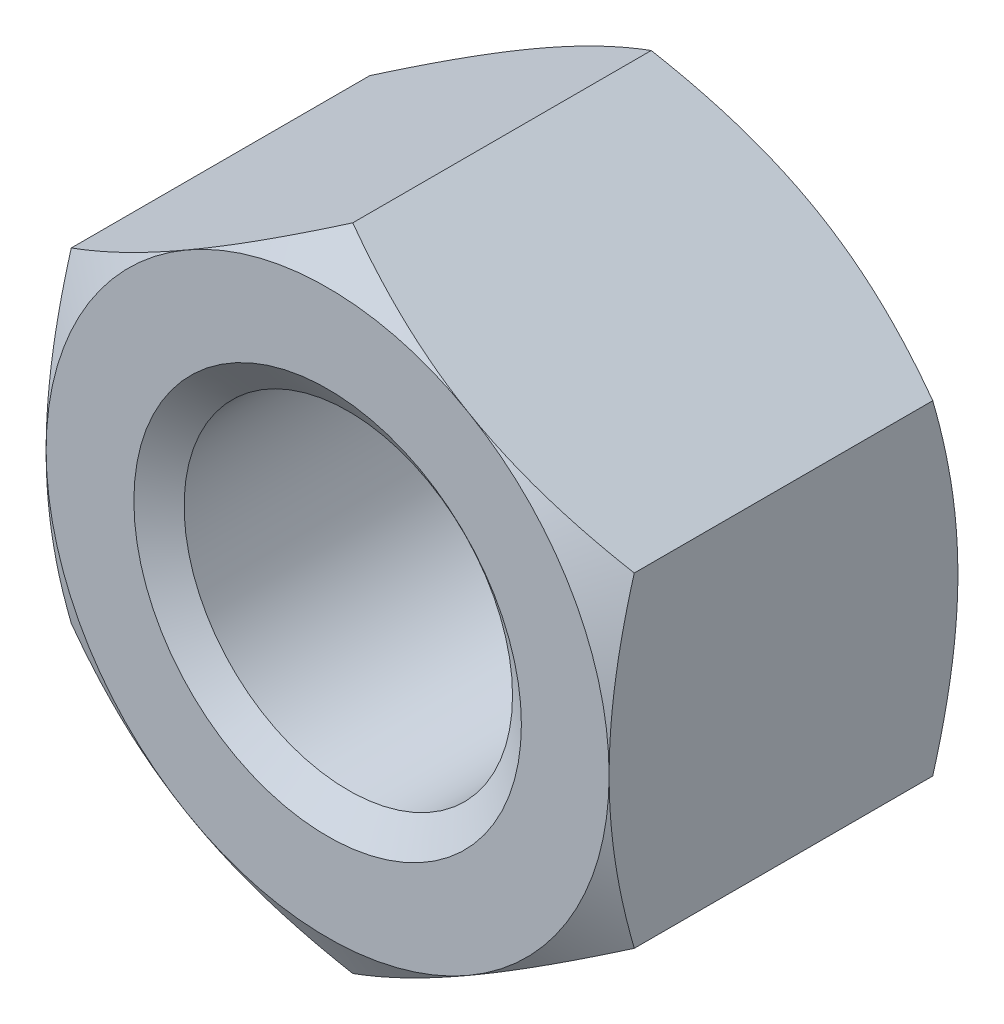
ISO-10303-21;
HEADER;
FILE_DESCRIPTION(('STEP AP214'),'2;1');
FILE_NAME('part.step','',(''),(''),'','','');
FILE_SCHEMA(('AUTOMOTIVE_DESIGN { 1 0 10303 214 1 1 1 1 }'));
ENDSEC;
DATA;
#1=APPLICATION_CONTEXT('core data for automotive mechanical design processes');
#2=APPLICATION_PROTOCOL_DEFINITION('international standard','automotive_design',2000,#1);
#3=PRODUCT_CONTEXT('',#1,'mechanical');
#4=PRODUCT('Part','Part','',(#3));
#5=PRODUCT_RELATED_PRODUCT_CATEGORY('part','',(#4));
#6=PRODUCT_DEFINITION_FORMATION('','',#4);
#7=PRODUCT_DEFINITION_CONTEXT('part definition',#1,'design');
#8=PRODUCT_DEFINITION('design','',#6,#7);
#9=PRODUCT_DEFINITION_SHAPE('','',#8);
#10=(LENGTH_UNIT() NAMED_UNIT(*) SI_UNIT(.MILLI.,.METRE.));
#11=(NAMED_UNIT(*) PLANE_ANGLE_UNIT() SI_UNIT($,.RADIAN.));
#12=(NAMED_UNIT(*) SI_UNIT($,.STERADIAN.) SOLID_ANGLE_UNIT());
#13=UNCERTAINTY_MEASURE_WITH_UNIT(LENGTH_MEASURE(1.E-05),#10,'distance_accuracy_value','');
#14=(GEOMETRIC_REPRESENTATION_CONTEXT(3) GLOBAL_UNCERTAINTY_ASSIGNED_CONTEXT((#13)) GLOBAL_UNIT_ASSIGNED_CONTEXT((#10,
#11,#12)) REPRESENTATION_CONTEXT('',''));
#15=CARTESIAN_POINT('',(0.,0.,0.));
#16=DIRECTION('',(0.,0.,1.));
#17=DIRECTION('',(1.,0.,0.));
#18=AXIS2_PLACEMENT_3D('',#15,#16,#17);
#19=CARTESIAN_POINT('',(0.,0.,-22.3));
#20=DIRECTION('',(0.,0.,1.));
#21=DIRECTION('',(1.,0.,0.));
#22=AXIS2_PLACEMENT_3D('',#19,#20,#21);
#23=CYLINDRICAL_SURFACE('',#22,10.5);
#24=CARTESIAN_POINT('',(0.,0.,-1.32339224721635));
#25=DIRECTION('',(0.,0.,1.));
#26=DIRECTION('',(1.,0.,0.));
#27=AXIS2_PLACEMENT_3D('',#24,#25,#26);
#28=CIRCLE('',#27,10.5);
#29=CARTESIAN_POINT('',(10.5,0.,-1.32339224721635));
#30=VERTEX_POINT('',#29);
#31=EDGE_CURVE('E324',#30,#30,#28,.T.);
#32=ORIENTED_EDGE('',*,*,#31,.T.);
#33=EDGE_LOOP('',(#32));
#34=FACE_BOUND('',#33,.T.);
#35=CARTESIAN_POINT('',(0.,0.,-20.9766077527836));
#36=DIRECTION('',(0.,0.,1.));
#37=DIRECTION('',(1.,0.,0.));
#38=AXIS2_PLACEMENT_3D('',#35,#36,#37);
#39=CIRCLE('',#38,10.5);
#40=CARTESIAN_POINT('',(10.5,0.,-20.9766077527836));
#41=VERTEX_POINT('',#40);
#42=EDGE_CURVE('E327',#41,#41,#39,.T.);
#43=ORIENTED_EDGE('',*,*,#42,.F.);
#44=EDGE_LOOP('',(#43));
#45=FACE_BOUND('',#44,.T.);
#46=ADVANCED_FACE('F39',(#34,#45),#23,.F.);
#47=CARTESIAN_POINT('',(0.,20.7846096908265,-22.3));
#48=DIRECTION('',(-0.5,0.866025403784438,0.));
#49=DIRECTION('',(-0.866025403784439,-0.5,0.));
#50=AXIS2_PLACEMENT_3D('',#47,#48,#49);
#51=PLANE('',#50);
#52=DIRECTION('',(0.,0.,1.));
#53=VECTOR('',#52,1.);
#54=CARTESIAN_POINT('',(-18.,10.3923048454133,-22.3));
#55=LINE('',#54,#53);
#56=CARTESIAN_POINT('',(-18.,10.3923048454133,-20.6923048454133));
#57=VERTEX_POINT('',#56);
#58=CARTESIAN_POINT('',(-18.,10.3923048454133,-1.60769515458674));
#59=VERTEX_POINT('',#58);
#60=EDGE_CURVE('E168',#57,#59,#55,.T.);
#61=ORIENTED_EDGE('',*,*,#60,.T.);
#62=CARTESIAN_POINT('',(-18.0002,10.3921893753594,-1.60776182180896));
#63=CARTESIAN_POINT('',(-17.6045674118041,10.6206079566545,-1.47589336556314));
#64=CARTESIAN_POINT('',(-17.2073916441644,10.8499174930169,-1.3500088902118));
#65=CARTESIAN_POINT('',(-16.4098552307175,11.310375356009,-1.11187123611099));
#66=CARTESIAN_POINT('',(-16.0094935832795,11.5415242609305,-0.999622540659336));
#67=CARTESIAN_POINT('',(-15.2048116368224,12.0061075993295,-0.790265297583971));
#68=CARTESIAN_POINT('',(-14.8004842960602,12.2395460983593,-0.693192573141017));
#69=CARTESIAN_POINT('',(-13.9890201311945,12.7080451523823,-0.516271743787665));
#70=CARTESIAN_POINT('',(-13.5818834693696,12.9431056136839,-0.436422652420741));
#71=CARTESIAN_POINT('',(-12.7752328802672,13.4088255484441,-0.297345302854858));
#72=CARTESIAN_POINT('',(-12.3757788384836,13.6394504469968,-0.237656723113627));
#73=CARTESIAN_POINT('',(-11.5750403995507,14.1017570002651,-0.137572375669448));
#74=CARTESIAN_POINT('',(-11.1737559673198,14.3334386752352,-0.0971769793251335));
#75=CARTESIAN_POINT('',(-10.370513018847,14.7971912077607,-0.0366989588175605));
#76=CARTESIAN_POINT('',(-9.96855587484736,15.0292612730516,-0.0165921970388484));
#77=CARTESIAN_POINT('',(-9.16427056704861,15.4936156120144,0.00287614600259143));
#78=CARTESIAN_POINT('',(-8.7619424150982,15.7258998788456,0.00223836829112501));
#79=CARTESIAN_POINT('',(-8.00978065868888,16.1601606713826,-0.0183335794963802));
#80=CARTESIAN_POINT('',(-7.65989346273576,16.3621681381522,-0.0357591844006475));
#81=CARTESIAN_POINT('',(-6.96095368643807,16.765701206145,-0.0859690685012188));
#82=CARTESIAN_POINT('',(-6.61190109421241,16.9672268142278,-0.118753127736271));
#83=CARTESIAN_POINT('',(-5.91476277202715,17.3697198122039,-0.199111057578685));
#84=CARTESIAN_POINT('',(-5.56667820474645,17.5706865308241,-0.24669830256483));
#85=CARTESIAN_POINT('',(-4.87216610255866,17.9716632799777,-0.355822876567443));
#86=CARTESIAN_POINT('',(-4.5257385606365,18.1716733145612,-0.417360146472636));
#87=CARTESIAN_POINT('',(-3.47411308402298,18.7788295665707,-0.624462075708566));
#88=CARTESIAN_POINT('',(-2.771960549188,19.1842175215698,-0.790677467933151));
#89=CARTESIAN_POINT('',(-1.37812528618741,19.9889486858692,-1.16791817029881));
#90=CARTESIAN_POINT('',(-0.686424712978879,20.3883021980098,-1.37885488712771));
#91=CARTESIAN_POINT('',(0.000200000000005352,20.7847251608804,-1.60776182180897));
#92=B_SPLINE_CURVE_WITH_KNOTS('',3,(#62,#63,#64,#65,#66,#67,#68,#69,#70,#71,#72,#73,#74,#75,#76,
#77,#78,#79,#80,#81,#82,#83,#84,#85,#86,#87,#88,#89,#90,#91),.UNSPECIFIED.,.F.,.F.,(4,2,2,2,2,2,
2,2,2,2,2,2,2,2,4),(0.,1.42650335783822,2.85347447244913,4.28376471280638,5.71397301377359,
7.10888071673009,8.50381526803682,9.89708828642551,11.2903182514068,12.5031974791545,
13.7160593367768,14.9300201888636,16.1439758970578,18.6253607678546,21.1018751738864),.UNSPECIFIED.);
#93=CARTESIAN_POINT('',(-9.00000000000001,15.5884572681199,0.));
#94=VERTEX_POINT('',#93);
#95=EDGE_CURVE('E64',#59,#94,#92,.T.);
#96=ORIENTED_EDGE('',*,*,#95,.T.);
#97=CARTESIAN_POINT('',(0.,20.7846096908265,-1.60769515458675));
#98=VERTEX_POINT('',#97);
#99=EDGE_CURVE('E210',#94,#98,#92,.T.);
#100=ORIENTED_EDGE('',*,*,#99,.T.);
#101=DIRECTION('',(0.,0.,1.));
#102=VECTOR('',#101,1.);
#103=CARTESIAN_POINT('',(0.,20.7846096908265,-22.3));
#104=LINE('',#103,#102);
#105=CARTESIAN_POINT('',(0.,20.7846096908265,-20.6923048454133));
#106=VERTEX_POINT('',#105);
#107=EDGE_CURVE('E153',#106,#98,#104,.T.);
#108=ORIENTED_EDGE('',*,*,#107,.F.);
#109=CARTESIAN_POINT('',(-18.0002,10.3921893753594,-20.692238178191));
#110=CARTESIAN_POINT('',(-17.6045674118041,10.6206079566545,-20.8241066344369));
#111=CARTESIAN_POINT('',(-17.2073916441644,10.8499174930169,-20.9499911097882));
#112=CARTESIAN_POINT('',(-16.4098552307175,11.310375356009,-21.188128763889));
#113=CARTESIAN_POINT('',(-16.0094935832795,11.5415242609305,-21.3003774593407));
#114=CARTESIAN_POINT('',(-15.2048116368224,12.0061075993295,-21.509734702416));
#115=CARTESIAN_POINT('',(-14.8004842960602,12.2395460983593,-21.606807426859));
#116=CARTESIAN_POINT('',(-13.9890201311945,12.7080451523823,-21.7837282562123));
#117=CARTESIAN_POINT('',(-13.5818834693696,12.9431056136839,-21.8635773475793));
#118=CARTESIAN_POINT('',(-12.7752328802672,13.4088255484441,-22.0026546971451));
#119=CARTESIAN_POINT('',(-12.3757788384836,13.6394504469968,-22.0623432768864));
#120=CARTESIAN_POINT('',(-11.5750403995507,14.1017570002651,-22.1624276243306));
#121=CARTESIAN_POINT('',(-11.1737559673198,14.3334386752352,-22.2028230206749));
#122=CARTESIAN_POINT('',(-10.370513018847,14.7971912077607,-22.2633010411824));
#123=CARTESIAN_POINT('',(-9.96855587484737,15.0292612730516,-22.2834078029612));
#124=CARTESIAN_POINT('',(-9.16427056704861,15.4936156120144,-22.3028761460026));
#125=CARTESIAN_POINT('',(-8.7619424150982,15.7258998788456,-22.3022383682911));
#126=CARTESIAN_POINT('',(-8.00978065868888,16.1601606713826,-22.2816664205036));
#127=CARTESIAN_POINT('',(-7.65989346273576,16.3621681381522,-22.2642408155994));
#128=CARTESIAN_POINT('',(-6.96095368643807,16.765701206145,-22.2140309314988));
#129=CARTESIAN_POINT('',(-6.61190109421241,16.9672268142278,-22.1812468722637));
#130=CARTESIAN_POINT('',(-5.91476277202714,17.3697198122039,-22.1008889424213));
#131=CARTESIAN_POINT('',(-5.56667820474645,17.5706865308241,-22.0533016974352));
#132=CARTESIAN_POINT('',(-4.87216610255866,17.9716632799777,-21.9441771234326));
#133=CARTESIAN_POINT('',(-4.5257385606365,18.1716733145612,-21.8826398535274));
#134=CARTESIAN_POINT('',(-3.47411308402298,18.7788295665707,-21.6755379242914));
#135=CARTESIAN_POINT('',(-2.771960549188,19.1842175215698,-21.5093225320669));
#136=CARTESIAN_POINT('',(-1.37812528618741,19.9889486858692,-21.1320818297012));
#137=CARTESIAN_POINT('',(-0.686424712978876,20.3883021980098,-20.9211451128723));
#138=CARTESIAN_POINT('',(0.000200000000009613,20.7847251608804,-20.692238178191));
#139=B_SPLINE_CURVE_WITH_KNOTS('',3,(#109,#110,#111,#112,#113,#114,#115,#116,#117,#118,#119,
#120,#121,#122,#123,#124,#125,#126,#127,#128,#129,#130,#131,#132,#133,#134,#135,#136,#137,#138),
.UNSPECIFIED.,.F.,.F.,(4,2,2,2,2,2,2,2,2,2,2,2,2,2,4),(0.,1.42650335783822,2.85347447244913,
4.28376471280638,5.71397301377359,7.10888071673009,8.50381526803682,9.89708828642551,
11.2903182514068,12.5031974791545,13.7160593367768,14.9300201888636,16.1439758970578,
18.6253607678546,21.1018751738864),.UNSPECIFIED.);
#140=CARTESIAN_POINT('',(-9.00000000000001,15.5884572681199,-22.3));
#141=VERTEX_POINT('',#140);
#142=EDGE_CURVE('E170',#141,#106,#139,.T.);
#143=ORIENTED_EDGE('',*,*,#142,.F.);
#144=EDGE_CURVE('E198',#57,#141,#139,.T.);
#145=ORIENTED_EDGE('',*,*,#144,.F.);
#146=EDGE_LOOP('',(#61,#96,#100,#108,#143,#145));
#147=FACE_BOUND('',#146,.T.);
#148=ADVANCED_FACE('F41',(#147),#51,.T.);
#149=CARTESIAN_POINT('',(18.,10.3923048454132,-22.3));
#150=DIRECTION('',(0.500000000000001,0.866025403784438,0.));
#151=DIRECTION('',(-0.866025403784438,0.500000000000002,0.));
#152=AXIS2_PLACEMENT_3D('',#149,#150,#151);
#153=PLANE('',#152);
#154=ORIENTED_EDGE('',*,*,#107,.T.);
#155=CARTESIAN_POINT('',(-0.000199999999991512,20.7847251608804,-1.60776182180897));
#156=CARTESIAN_POINT('',(0.395432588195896,20.5563065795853,-1.47589336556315));
#157=CARTESIAN_POINT('',(0.792608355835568,20.3269970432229,-1.35000889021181));
#158=CARTESIAN_POINT('',(1.59014476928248,19.8665391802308,-1.111871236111));
#159=CARTESIAN_POINT('',(1.99050641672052,19.6353902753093,-0.999622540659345));
#160=CARTESIAN_POINT('',(2.79518836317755,19.1708069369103,-0.790265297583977));
#161=CARTESIAN_POINT('',(3.19951570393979,18.9373684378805,-0.693192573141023));
#162=CARTESIAN_POINT('',(4.01097986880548,18.4688693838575,-0.516271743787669));
#163=CARTESIAN_POINT('',(4.41811653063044,18.2338089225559,-0.436422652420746));
#164=CARTESIAN_POINT('',(5.22476711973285,17.7680889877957,-0.29734530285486));
#165=CARTESIAN_POINT('',(5.62422116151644,17.537464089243,-0.237656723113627));
#166=CARTESIAN_POINT('',(6.4249596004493,17.0751575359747,-0.137572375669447));
#167=CARTESIAN_POINT('',(6.82624403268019,16.8434758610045,-0.0971769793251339));
#168=CARTESIAN_POINT('',(7.62948698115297,16.3797233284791,-0.0366989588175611));
#169=CARTESIAN_POINT('',(8.03144412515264,16.1476532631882,-0.0165921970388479));
#170=CARTESIAN_POINT('',(8.83572943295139,15.6832989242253,0.00287614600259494));
#171=CARTESIAN_POINT('',(9.2380575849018,15.4510146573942,0.00223836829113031));
#172=CARTESIAN_POINT('',(9.99021934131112,15.0167538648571,-0.0183335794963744));
#173=CARTESIAN_POINT('',(10.3401065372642,14.8147463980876,-0.0357591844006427));
#174=CARTESIAN_POINT('',(11.0390463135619,14.4112133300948,-0.085969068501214));
#175=CARTESIAN_POINT('',(11.3880989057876,14.209687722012,-0.118753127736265));
#176=CARTESIAN_POINT('',(12.0852372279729,13.8071947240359,-0.199111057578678));
#177=CARTESIAN_POINT('',(12.4333217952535,13.6062280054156,-0.246698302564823));
#178=CARTESIAN_POINT('',(13.1278338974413,13.2052512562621,-0.355822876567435));
#179=CARTESIAN_POINT('',(13.4742614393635,13.0052412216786,-0.417360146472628));
#180=CARTESIAN_POINT('',(14.525886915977,12.3980849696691,-0.624462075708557));
#181=CARTESIAN_POINT('',(15.228039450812,11.99269701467,-0.790677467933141));
#182=CARTESIAN_POINT('',(16.6218747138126,11.1879658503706,-1.1679181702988));
#183=CARTESIAN_POINT('',(17.3135752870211,10.78861233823,-1.3788548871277));
#184=CARTESIAN_POINT('',(18.0002,10.3921893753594,-1.60776182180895));
#185=B_SPLINE_CURVE_WITH_KNOTS('',3,(#155,#156,#157,#158,#159,#160,#161,#162,#163,#164,#165,
#166,#167,#168,#169,#170,#171,#172,#173,#174,#175,#176,#177,#178,#179,#180,#181,#182,#183,#184),
.UNSPECIFIED.,.F.,.F.,(4,2,2,2,2,2,2,2,2,2,2,2,2,2,4),(0.,1.42650335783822,2.85347447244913,
4.28376471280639,5.7139730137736,7.1088807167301,8.50381526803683,9.89708828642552,
11.2903182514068,12.5031974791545,13.7160593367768,14.9300201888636,16.1439758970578,
18.6253607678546,21.1018751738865),.UNSPECIFIED.);
#186=CARTESIAN_POINT('',(9.00000000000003,15.5884572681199,0.));
#187=VERTEX_POINT('',#186);
#188=EDGE_CURVE('E146',#98,#187,#185,.T.);
#189=ORIENTED_EDGE('',*,*,#188,.T.);
#190=CARTESIAN_POINT('',(18.,10.3923048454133,-1.60769515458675));
#191=VERTEX_POINT('',#190);
#192=EDGE_CURVE('E132',#187,#191,#185,.T.);
#193=ORIENTED_EDGE('',*,*,#192,.T.);
#194=DIRECTION('',(0.,0.,1.));
#195=VECTOR('',#194,1.);
#196=CARTESIAN_POINT('',(18.,10.3923048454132,-22.3));
#197=LINE('',#196,#195);
#198=CARTESIAN_POINT('',(18.,10.3923048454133,-20.6923048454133));
#199=VERTEX_POINT('',#198);
#200=EDGE_CURVE('E145',#199,#191,#197,.T.);
#201=ORIENTED_EDGE('',*,*,#200,.F.);
#202=CARTESIAN_POINT('',(-0.000199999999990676,20.7847251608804,-20.692238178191));
#203=CARTESIAN_POINT('',(0.395432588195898,20.5563065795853,-20.8241066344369));
#204=CARTESIAN_POINT('',(0.792608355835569,20.3269970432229,-20.9499911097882));
#205=CARTESIAN_POINT('',(1.59014476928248,19.8665391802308,-21.188128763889));
#206=CARTESIAN_POINT('',(1.99050641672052,19.6353902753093,-21.3003774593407));
#207=CARTESIAN_POINT('',(2.79518836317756,19.1708069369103,-21.509734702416));
#208=CARTESIAN_POINT('',(3.19951570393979,18.9373684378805,-21.606807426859));
#209=CARTESIAN_POINT('',(4.01097986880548,18.4688693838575,-21.7837282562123));
#210=CARTESIAN_POINT('',(4.41811653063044,18.2338089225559,-21.8635773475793));
#211=CARTESIAN_POINT('',(5.22476711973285,17.7680889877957,-22.0026546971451));
#212=CARTESIAN_POINT('',(5.62422116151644,17.537464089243,-22.0623432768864));
#213=CARTESIAN_POINT('',(6.4249596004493,17.0751575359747,-22.1624276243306));
#214=CARTESIAN_POINT('',(6.82624403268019,16.8434758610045,-22.2028230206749));
#215=CARTESIAN_POINT('',(7.62948698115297,16.3797233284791,-22.2633010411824));
#216=CARTESIAN_POINT('',(8.03144412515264,16.1476532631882,-22.2834078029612));
#217=CARTESIAN_POINT('',(8.83572943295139,15.6832989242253,-22.3028761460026));
#218=CARTESIAN_POINT('',(9.2380575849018,15.4510146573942,-22.3022383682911));
#219=CARTESIAN_POINT('',(9.99021934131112,15.0167538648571,-22.2816664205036));
#220=CARTESIAN_POINT('',(10.3401065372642,14.8147463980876,-22.2642408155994));
#221=CARTESIAN_POINT('',(11.0390463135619,14.4112133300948,-22.2140309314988));
#222=CARTESIAN_POINT('',(11.3880989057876,14.209687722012,-22.1812468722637));
#223=CARTESIAN_POINT('',(12.0852372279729,13.8071947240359,-22.1008889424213));
#224=CARTESIAN_POINT('',(12.4333217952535,13.6062280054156,-22.0533016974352));
#225=CARTESIAN_POINT('',(13.1278338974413,13.2052512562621,-21.9441771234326));
#226=CARTESIAN_POINT('',(13.4742614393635,13.0052412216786,-21.8826398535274));
#227=CARTESIAN_POINT('',(14.525886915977,12.3980849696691,-21.6755379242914));
#228=CARTESIAN_POINT('',(15.228039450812,11.99269701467,-21.5093225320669));
#229=CARTESIAN_POINT('',(16.6218747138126,11.1879658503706,-21.1320818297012));
#230=CARTESIAN_POINT('',(17.3135752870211,10.78861233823,-20.9211451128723));
#231=CARTESIAN_POINT('',(18.0002,10.3921893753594,-20.6922381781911));
#232=B_SPLINE_CURVE_WITH_KNOTS('',3,(#202,#203,#204,#205,#206,#207,#208,#209,#210,#211,#212,
#213,#214,#215,#216,#217,#218,#219,#220,#221,#222,#223,#224,#225,#226,#227,#228,#229,#230,#231),
.UNSPECIFIED.,.F.,.F.,(4,2,2,2,2,2,2,2,2,2,2,2,2,2,4),(0.,1.42650335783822,2.85347447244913,
4.28376471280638,5.7139730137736,7.1088807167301,8.50381526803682,9.89708828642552,
11.2903182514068,12.5031974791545,13.7160593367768,14.9300201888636,16.1439758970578,
18.6253607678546,21.1018751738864),.UNSPECIFIED.);
#233=CARTESIAN_POINT('',(9.00000000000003,15.5884572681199,-22.3));
#234=VERTEX_POINT('',#233);
#235=EDGE_CURVE('E258',#234,#199,#232,.T.);
#236=ORIENTED_EDGE('',*,*,#235,.F.);
#237=EDGE_CURVE('E264',#106,#234,#232,.T.);
#238=ORIENTED_EDGE('',*,*,#237,.F.);
#239=EDGE_LOOP('',(#154,#189,#193,#201,#236,#238));
#240=FACE_BOUND('',#239,.T.);
#241=ADVANCED_FACE('F143',(#240),#153,.T.);
#242=CARTESIAN_POINT('',(18.,10.3923048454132,-22.3));
#243=DIRECTION('',(-1.,0.,0.));
#244=DIRECTION('',(0.,0.,1.));
#245=AXIS2_PLACEMENT_3D('',#242,#243,#244);
#246=PLANE('',#245);
#247=CARTESIAN_POINT('',(18.,-27.5619239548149,-8.61348069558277));
#248=CARTESIAN_POINT('',(18.,-27.1667877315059,-8.42247770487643));
#249=CARTESIAN_POINT('',(18.,-26.7711739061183,-8.23246323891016));
#250=CARTESIAN_POINT('',(18.,-25.978890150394,-7.85463825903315));
#251=CARTESIAN_POINT('',(18.,-25.5822202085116,-7.66682776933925));
#252=CARTESIAN_POINT('',(18.,-24.3903587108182,-7.106988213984));
#253=CARTESIAN_POINT('',(18.,-23.5934439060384,-6.73861331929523));
#254=CARTESIAN_POINT('',(18.,-21.989547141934,-6.01187832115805));
#255=CARTESIAN_POINT('',(18.,-21.1825336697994,-5.65358759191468));
#256=CARTESIAN_POINT('',(18.,-19.5618746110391,-4.9523894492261));
#257=CARTESIAN_POINT('',(18.,-18.7482293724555,-4.60948123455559));
#258=CARTESIAN_POINT('',(18.,-17.1029123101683,-3.93907746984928));
#259=CARTESIAN_POINT('',(18.,-16.2711418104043,-3.61182282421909));
#260=CARTESIAN_POINT('',(18.,-14.5977842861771,-2.98294292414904));
#261=CARTESIAN_POINT('',(18.,-13.7561961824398,-2.681320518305));
#262=CARTESIAN_POINT('',(18.,-12.0636207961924,-2.11181367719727));
#263=CARTESIAN_POINT('',(18.,-11.2126578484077,-1.84385751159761));
#264=CARTESIAN_POINT('',(18.,-9.49855213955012,-1.35037221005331));
#265=CARTESIAN_POINT('',(18.,-8.63541331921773,-1.12482967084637));
#266=CARTESIAN_POINT('',(18.,-7.33140916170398,-0.826582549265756));
#267=CARTESIAN_POINT('',(18.,-6.89509921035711,-0.733829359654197));
#268=CARTESIAN_POINT('',(18.,-6.01957542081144,-0.563143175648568));
#269=CARTESIAN_POINT('',(18.,-5.58036164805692,-0.485209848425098));
#270=CARTESIAN_POINT('',(18.,-4.69932499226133,-0.345545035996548));
#271=CARTESIAN_POINT('',(18.,-4.25750195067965,-0.283814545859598));
#272=CARTESIAN_POINT('',(18.,-3.37175302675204,-0.177795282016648));
#273=CARTESIAN_POINT('',(18.,-2.92782714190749,-0.133506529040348));
#274=CARTESIAN_POINT('',(18.,-2.04133804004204,-0.0635630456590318));
#275=CARTESIAN_POINT('',(18.,-1.59878408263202,-0.0377917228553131));
#276=CARTESIAN_POINT('',(18.,-0.712983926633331,-0.00501858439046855));
#277=CARTESIAN_POINT('',(18.,-0.269737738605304,0.0019835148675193));
#278=CARTESIAN_POINT('',(18.,0.616528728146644,-0.00294785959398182));
#279=CARTESIAN_POINT('',(18.,1.0595490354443,-0.0148760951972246));
#280=CARTESIAN_POINT('',(18.,1.9446967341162,-0.0573715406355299));
#281=CARTESIAN_POINT('',(18.,2.38682408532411,-0.0879395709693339));
#282=CARTESIAN_POINT('',(18.,3.45808110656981,-0.183949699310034));
#283=CARTESIAN_POINT('',(18.,4.08639173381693,-0.258712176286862));
#284=CARTESIAN_POINT('',(18.,5.33809089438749,-0.441718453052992));
#285=CARTESIAN_POINT('',(18.,5.96147868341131,-0.549967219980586));
#286=CARTESIAN_POINT('',(18.,7.82534534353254,-0.919513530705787));
#287=CARTESIAN_POINT('',(18.,9.05709271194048,-1.22536507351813));
#288=CARTESIAN_POINT('',(18.,10.8995809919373,-1.75275444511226));
#289=CARTESIAN_POINT('',(18.,11.5199484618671,-1.94256699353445));
#290=CARTESIAN_POINT('',(18.,12.7546900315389,-2.3411171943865));
#291=CARTESIAN_POINT('',(18.,13.3690635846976,-2.5498565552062));
#292=CARTESIAN_POINT('',(18.,14.5887549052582,-2.98181266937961));
#293=CARTESIAN_POINT('',(18.,15.1941042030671,-3.20494114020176));
#294=CARTESIAN_POINT('',(18.,16.0983156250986,-3.54929436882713));
#295=CARTESIAN_POINT('',(18.,16.3990354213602,-3.66566915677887));
#296=CARTESIAN_POINT('',(18.,16.999306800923,-3.90137756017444));
#297=CARTESIAN_POINT('',(18.,17.2988584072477,-4.02071111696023));
#298=CARTESIAN_POINT('',(18.,17.5978664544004,-4.14139052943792));
#299=B_SPLINE_CURVE_WITH_KNOTS('',3,(#247,#248,#249,#250,#251,#252,#253,#254,#255,#256,#257,
#258,#259,#260,#261,#262,#263,#264,#265,#266,#267,#268,#269,#270,#271,#272,#273,#274,#275,#276,
#277,#278,#279,#280,#281,#282,#283,#284,#285,#286,#287,#288,#289,#290,#291,#292,#293,#294,#295,
#296,#297,#298),.UNSPECIFIED.,.F.,.F.,(4,2,2,2,2,2,2,2,2,2,2,2,2,2,2,2,2,2,2,2,2,2,2,2,2,4),(0.,
1.3166344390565,2.63328333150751,5.2670092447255,7.91580691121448,10.5644664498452,
13.2456434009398,15.9271179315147,18.6027786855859,21.2775924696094,22.6155612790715,
23.9535000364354,25.2915209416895,26.6295434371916,27.9590656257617,29.2885677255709,
30.6177020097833,31.9468948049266,33.8440459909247,35.7414787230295,39.5436531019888,
41.4897689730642,43.436060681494,45.3713764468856,46.338719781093,47.3060439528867),.UNSPECIFIED.);
#300=CARTESIAN_POINT('',(18.,-10.3923048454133,-1.60769515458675));
#301=VERTEX_POINT('',#300);
#302=CARTESIAN_POINT('',(18.,0.,0.));
#303=VERTEX_POINT('',#302);
#304=EDGE_CURVE('E138',#301,#303,#299,.T.);
#305=ORIENTED_EDGE('',*,*,#304,.F.);
#306=DIRECTION('',(0.,0.,1.));
#307=VECTOR('',#306,1.);
#308=CARTESIAN_POINT('',(18.,-10.3923048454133,-22.3));
#309=LINE('',#308,#307);
#310=CARTESIAN_POINT('',(18.,-10.3923048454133,-20.6923048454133));
#311=VERTEX_POINT('',#310);
#312=EDGE_CURVE('E154',#311,#301,#309,.T.);
#313=ORIENTED_EDGE('',*,*,#312,.F.);
#314=CARTESIAN_POINT('',(18.,-27.5619239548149,-13.6865193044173));
#315=CARTESIAN_POINT('',(18.,-27.1667877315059,-13.8775222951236));
#316=CARTESIAN_POINT('',(18.,-26.7711739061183,-14.0675367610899));
#317=CARTESIAN_POINT('',(18.,-25.978890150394,-14.4453617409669));
#318=CARTESIAN_POINT('',(18.,-25.5822202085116,-14.6331722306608));
#319=CARTESIAN_POINT('',(18.,-24.3903587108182,-15.193011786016));
#320=CARTESIAN_POINT('',(18.,-23.5934439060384,-15.5613866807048));
#321=CARTESIAN_POINT('',(18.,-21.989547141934,-16.288121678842));
#322=CARTESIAN_POINT('',(18.,-21.1825336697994,-16.6464124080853));
#323=CARTESIAN_POINT('',(18.,-19.5618746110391,-17.3476105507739));
#324=CARTESIAN_POINT('',(18.,-18.7482293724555,-17.6905187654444));
#325=CARTESIAN_POINT('',(18.,-17.1029123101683,-18.3609225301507));
#326=CARTESIAN_POINT('',(18.,-16.2711418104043,-18.6881771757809));
#327=CARTESIAN_POINT('',(18.,-14.5977842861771,-19.317057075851));
#328=CARTESIAN_POINT('',(18.,-13.7561961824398,-19.618679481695));
#329=CARTESIAN_POINT('',(18.,-12.0636207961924,-20.1881863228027));
#330=CARTESIAN_POINT('',(18.,-11.2126578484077,-20.4561424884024));
#331=CARTESIAN_POINT('',(18.,-9.49855213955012,-20.9496277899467));
#332=CARTESIAN_POINT('',(18.,-8.63541331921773,-21.1751703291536));
#333=CARTESIAN_POINT('',(18.,-7.33140916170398,-21.4734174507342));
#334=CARTESIAN_POINT('',(18.,-6.89509921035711,-21.5661706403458));
#335=CARTESIAN_POINT('',(18.,-6.01957542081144,-21.7368568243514));
#336=CARTESIAN_POINT('',(18.,-5.58036164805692,-21.8147901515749));
#337=CARTESIAN_POINT('',(18.,-4.69932499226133,-21.9544549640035));
#338=CARTESIAN_POINT('',(18.,-4.25750195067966,-22.0161854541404));
#339=CARTESIAN_POINT('',(18.,-3.37175302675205,-22.1222047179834));
#340=CARTESIAN_POINT('',(18.,-2.92782714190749,-22.1664934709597));
#341=CARTESIAN_POINT('',(18.,-2.04133804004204,-22.236436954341));
#342=CARTESIAN_POINT('',(18.,-1.59878408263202,-22.2622082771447));
#343=CARTESIAN_POINT('',(18.,-0.712983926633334,-22.2949814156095));
#344=CARTESIAN_POINT('',(18.,-0.269737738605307,-22.3019835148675));
#345=CARTESIAN_POINT('',(18.,0.616528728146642,-22.297052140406));
#346=CARTESIAN_POINT('',(18.,1.0595490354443,-22.2851239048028));
#347=CARTESIAN_POINT('',(18.,1.9446967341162,-22.2426284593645));
#348=CARTESIAN_POINT('',(18.,2.3868240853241,-22.2120604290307));
#349=CARTESIAN_POINT('',(18.,3.45808110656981,-22.11605030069));
#350=CARTESIAN_POINT('',(18.,4.08639173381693,-22.0412878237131));
#351=CARTESIAN_POINT('',(18.,5.33809089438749,-21.858281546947));
#352=CARTESIAN_POINT('',(18.,5.96147868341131,-21.7500327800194));
#353=CARTESIAN_POINT('',(18.,7.82534534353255,-21.3804864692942));
#354=CARTESIAN_POINT('',(18.,9.05709271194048,-21.0746349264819));
#355=CARTESIAN_POINT('',(18.,10.8995809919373,-20.5472455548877));
#356=CARTESIAN_POINT('',(18.,11.5199484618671,-20.3574330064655));
#357=CARTESIAN_POINT('',(18.,12.7546900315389,-19.9588828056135));
#358=CARTESIAN_POINT('',(18.,13.3690635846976,-19.7501434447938));
#359=CARTESIAN_POINT('',(18.,14.5887549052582,-19.3181873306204));
#360=CARTESIAN_POINT('',(18.,15.1941042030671,-19.0950588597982));
#361=CARTESIAN_POINT('',(18.,16.0983156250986,-18.7507056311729));
#362=CARTESIAN_POINT('',(18.,16.3990354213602,-18.6343308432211));
#363=CARTESIAN_POINT('',(18.,16.999306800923,-18.3986224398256));
#364=CARTESIAN_POINT('',(18.,17.2988584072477,-18.2792888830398));
#365=CARTESIAN_POINT('',(18.,17.5978664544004,-18.1586094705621));
#366=B_SPLINE_CURVE_WITH_KNOTS('',3,(#314,#315,#316,#317,#318,#319,#320,#321,#322,#323,#324,
#325,#326,#327,#328,#329,#330,#331,#332,#333,#334,#335,#336,#337,#338,#339,#340,#341,#342,#343,
#344,#345,#346,#347,#348,#349,#350,#351,#352,#353,#354,#355,#356,#357,#358,#359,#360,#361,#362,
#363,#364,#365),.UNSPECIFIED.,.F.,.F.,(4,2,2,2,2,2,2,2,2,2,2,2,2,2,2,2,2,2,2,2,2,2,2,2,2,4),(0.,
1.3166344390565,2.63328333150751,5.2670092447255,7.91580691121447,10.5644664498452,
13.2456434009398,15.9271179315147,18.6027786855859,21.2775924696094,22.6155612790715,
23.9535000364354,25.2915209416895,26.6295434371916,27.9590656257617,29.2885677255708,
30.6177020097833,31.9468948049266,33.8440459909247,35.7414787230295,39.5436531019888,
41.4897689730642,43.4360606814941,45.3713764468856,46.3387197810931,47.3060439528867),.UNSPECIFIED.);
#367=CARTESIAN_POINT('',(18.,0.,-22.3));
#368=VERTEX_POINT('',#367);
#369=EDGE_CURVE('E247',#311,#368,#366,.T.);
#370=ORIENTED_EDGE('',*,*,#369,.T.);
#371=EDGE_CURVE('E152',#368,#199,#366,.T.);
#372=ORIENTED_EDGE('',*,*,#371,.T.);
#373=ORIENTED_EDGE('',*,*,#200,.T.);
#374=EDGE_CURVE('E129',#303,#191,#299,.T.);
#375=ORIENTED_EDGE('',*,*,#374,.F.);
#376=EDGE_LOOP('',(#305,#313,#370,#372,#373,#375));
#377=FACE_BOUND('',#376,.T.);
#378=ADVANCED_FACE('F149',(#377),#246,.F.);
#379=CARTESIAN_POINT('',(0.,-20.7846096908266,-22.3));
#380=DIRECTION('',(0.500000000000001,-0.866025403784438,0.));
#381=DIRECTION('',(0.866025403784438,0.500000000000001,0.));
#382=AXIS2_PLACEMENT_3D('',#379,#380,#381);
#383=PLANE('',#382);
#384=ORIENTED_EDGE('',*,*,#312,.T.);
#385=CARTESIAN_POINT('',(18.0002,-10.3921893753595,-1.60776182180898));
#386=CARTESIAN_POINT('',(17.6045674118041,-10.6206079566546,-1.47589336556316));
#387=CARTESIAN_POINT('',(17.2073916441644,-10.8499174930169,-1.35000889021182));
#388=CARTESIAN_POINT('',(16.4098552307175,-11.310375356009,-1.11187123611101));
#389=CARTESIAN_POINT('',(16.0094935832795,-11.5415242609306,-0.999622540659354));
#390=CARTESIAN_POINT('',(15.2048116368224,-12.0061075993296,-0.790265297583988));
#391=CARTESIAN_POINT('',(14.8004842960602,-12.2395460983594,-0.693192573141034));
#392=CARTESIAN_POINT('',(13.9890201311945,-12.7080451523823,-0.516271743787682));
#393=CARTESIAN_POINT('',(13.5818834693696,-12.9431056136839,-0.43642265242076));
#394=CARTESIAN_POINT('',(12.7752328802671,-13.4088255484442,-0.297345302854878));
#395=CARTESIAN_POINT('',(12.3757788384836,-13.6394504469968,-0.237656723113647));
#396=CARTESIAN_POINT('',(11.5750403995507,-14.1017570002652,-0.13757237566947));
#397=CARTESIAN_POINT('',(11.1737559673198,-14.3334386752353,-0.0971769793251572));
#398=CARTESIAN_POINT('',(10.370513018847,-14.7971912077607,-0.0366989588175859));
#399=CARTESIAN_POINT('',(9.96855587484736,-15.0292612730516,-0.0165921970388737));
#400=CARTESIAN_POINT('',(9.1642705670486,-15.4936156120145,0.00287614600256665));
#401=CARTESIAN_POINT('',(8.76194241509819,-15.7258998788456,0.00223836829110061));
#402=CARTESIAN_POINT('',(8.00978065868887,-16.1601606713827,-0.0183335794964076));
#403=CARTESIAN_POINT('',(7.65989346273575,-16.3621681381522,-0.0357591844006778));
#404=CARTESIAN_POINT('',(6.96095368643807,-16.765701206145,-0.0859690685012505));
#405=CARTESIAN_POINT('',(6.6119010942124,-16.9672268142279,-0.118753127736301));
#406=CARTESIAN_POINT('',(5.91476277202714,-17.3697198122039,-0.199111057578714));
#407=CARTESIAN_POINT('',(5.56667820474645,-17.5706865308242,-0.246698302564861));
#408=CARTESIAN_POINT('',(4.87216610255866,-17.9716632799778,-0.355822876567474));
#409=CARTESIAN_POINT('',(4.5257385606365,-18.1716733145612,-0.417360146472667));
#410=CARTESIAN_POINT('',(3.47411308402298,-18.7788295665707,-0.624462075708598));
#411=CARTESIAN_POINT('',(2.771960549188,-19.1842175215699,-0.790677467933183));
#412=CARTESIAN_POINT('',(1.37812528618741,-19.9889486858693,-1.16791817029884));
#413=CARTESIAN_POINT('',(0.68642471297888,-20.3883021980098,-1.37885488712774));
#414=CARTESIAN_POINT('',(-0.000200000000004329,-20.7847251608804,-1.607761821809));
#415=B_SPLINE_CURVE_WITH_KNOTS('',3,(#385,#386,#387,#388,#389,#390,#391,#392,#393,#394,#395,
#396,#397,#398,#399,#400,#401,#402,#403,#404,#405,#406,#407,#408,#409,#410,#411,#412,#413,#414),
.UNSPECIFIED.,.F.,.F.,(4,2,2,2,2,2,2,2,2,2,2,2,2,2,4),(0.,1.42650335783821,2.85347447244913,
4.28376471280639,5.7139730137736,7.1088807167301,8.50381526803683,9.89708828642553,
11.2903182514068,12.5031974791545,13.7160593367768,14.9300201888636,16.1439758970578,
18.6253607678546,21.1018751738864),.UNSPECIFIED.);
#416=CARTESIAN_POINT('',(9.00000000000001,-15.5884572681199,0.));
#417=VERTEX_POINT('',#416);
#418=EDGE_CURVE('E285',#301,#417,#415,.T.);
#419=ORIENTED_EDGE('',*,*,#418,.T.);
#420=CARTESIAN_POINT('',(0.,-20.7846096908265,-1.60769515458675));
#421=VERTEX_POINT('',#420);
#422=EDGE_CURVE('E286',#417,#421,#415,.T.);
#423=ORIENTED_EDGE('',*,*,#422,.T.);
#424=DIRECTION('',(0.,0.,1.));
#425=VECTOR('',#424,1.);
#426=CARTESIAN_POINT('',(0.,-20.7846096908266,-22.3));
#427=LINE('',#426,#425);
#428=CARTESIAN_POINT('',(0.,-20.7846096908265,-20.6923048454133));
#429=VERTEX_POINT('',#428);
#430=EDGE_CURVE('E159',#429,#421,#427,.T.);
#431=ORIENTED_EDGE('',*,*,#430,.F.);
#432=CARTESIAN_POINT('',(18.0002,-10.3921893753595,-20.692238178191));
#433=CARTESIAN_POINT('',(17.6045674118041,-10.6206079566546,-20.8241066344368));
#434=CARTESIAN_POINT('',(17.2073916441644,-10.8499174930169,-20.9499911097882));
#435=CARTESIAN_POINT('',(16.4098552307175,-11.310375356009,-21.188128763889));
#436=CARTESIAN_POINT('',(16.0094935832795,-11.5415242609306,-21.3003774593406));
#437=CARTESIAN_POINT('',(15.2048116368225,-12.0061075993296,-21.509734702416));
#438=CARTESIAN_POINT('',(14.8004842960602,-12.2395460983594,-21.606807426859));
#439=CARTESIAN_POINT('',(13.9890201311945,-12.7080451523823,-21.7837282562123));
#440=CARTESIAN_POINT('',(13.5818834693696,-12.9431056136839,-21.8635773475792));
#441=CARTESIAN_POINT('',(12.7752328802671,-13.4088255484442,-22.0026546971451));
#442=CARTESIAN_POINT('',(12.3757788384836,-13.6394504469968,-22.0623432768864));
#443=CARTESIAN_POINT('',(11.5750403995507,-14.1017570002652,-22.1624276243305));
#444=CARTESIAN_POINT('',(11.1737559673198,-14.3334386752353,-22.2028230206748));
#445=CARTESIAN_POINT('',(10.370513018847,-14.7971912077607,-22.2633010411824));
#446=CARTESIAN_POINT('',(9.96855587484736,-15.0292612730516,-22.2834078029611));
#447=CARTESIAN_POINT('',(9.16427056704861,-15.4936156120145,-22.3028761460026));
#448=CARTESIAN_POINT('',(8.7619424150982,-15.7258998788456,-22.3022383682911));
#449=CARTESIAN_POINT('',(8.00978065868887,-16.1601606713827,-22.2816664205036));
#450=CARTESIAN_POINT('',(7.65989346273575,-16.3621681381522,-22.2642408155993));
#451=CARTESIAN_POINT('',(6.96095368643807,-16.765701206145,-22.2140309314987));
#452=CARTESIAN_POINT('',(6.6119010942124,-16.9672268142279,-22.1812468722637));
#453=CARTESIAN_POINT('',(5.91476277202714,-17.3697198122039,-22.1008889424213));
#454=CARTESIAN_POINT('',(5.56667820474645,-17.5706865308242,-22.0533016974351));
#455=CARTESIAN_POINT('',(4.87216610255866,-17.9716632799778,-21.9441771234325));
#456=CARTESIAN_POINT('',(4.5257385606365,-18.1716733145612,-21.8826398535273));
#457=CARTESIAN_POINT('',(3.47411308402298,-18.7788295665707,-21.6755379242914));
#458=CARTESIAN_POINT('',(2.771960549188,-19.1842175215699,-21.5093225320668));
#459=CARTESIAN_POINT('',(1.37812528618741,-19.9889486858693,-21.1320818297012));
#460=CARTESIAN_POINT('',(0.686424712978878,-20.3883021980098,-20.9211451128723));
#461=CARTESIAN_POINT('',(-0.00020000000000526,-20.7847251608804,-20.692238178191));
#462=B_SPLINE_CURVE_WITH_KNOTS('',3,(#432,#433,#434,#435,#436,#437,#438,#439,#440,#441,#442,
#443,#444,#445,#446,#447,#448,#449,#450,#451,#452,#453,#454,#455,#456,#457,#458,#459,#460,#461),
.UNSPECIFIED.,.F.,.F.,(4,2,2,2,2,2,2,2,2,2,2,2,2,2,4),(0.,1.42650335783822,2.85347447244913,
4.28376471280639,5.7139730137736,7.1088807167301,8.50381526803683,9.89708828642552,
11.2903182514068,12.5031974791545,13.7160593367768,14.9300201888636,16.1439758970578,
18.6253607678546,21.1018751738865),.UNSPECIFIED.);
#463=CARTESIAN_POINT('',(9.00000000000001,-15.5884572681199,-22.3));
#464=VERTEX_POINT('',#463);
#465=EDGE_CURVE('E240',#464,#429,#462,.T.);
#466=ORIENTED_EDGE('',*,*,#465,.F.);
#467=EDGE_CURVE('E361',#311,#464,#462,.T.);
#468=ORIENTED_EDGE('',*,*,#467,.F.);
#469=EDGE_LOOP('',(#384,#419,#423,#431,#466,#468));
#470=FACE_BOUND('',#469,.T.);
#471=ADVANCED_FACE('F300',(#470),#383,.T.);
#472=CARTESIAN_POINT('',(-18.,-10.3923048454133,-22.3));
#473=DIRECTION('',(-0.500000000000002,-0.866025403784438,0.));
#474=DIRECTION('',(0.866025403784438,-0.500000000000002,0.));
#475=AXIS2_PLACEMENT_3D('',#472,#473,#474);
#476=PLANE('',#475);
#477=ORIENTED_EDGE('',*,*,#430,.T.);
#478=CARTESIAN_POINT('',(0.000199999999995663,-20.7847251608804,-1.607761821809));
#479=CARTESIAN_POINT('',(-0.395432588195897,-20.5563065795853,-1.47589336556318));
#480=CARTESIAN_POINT('',(-0.792608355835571,-20.326997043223,-1.35000889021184));
#481=CARTESIAN_POINT('',(-1.59014476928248,-19.8665391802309,-1.11187123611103));
#482=CARTESIAN_POINT('',(-1.99050641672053,-19.6353902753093,-0.999622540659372));
#483=CARTESIAN_POINT('',(-2.79518836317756,-19.1708069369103,-0.790265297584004));
#484=CARTESIAN_POINT('',(-3.19951570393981,-18.9373684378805,-0.693192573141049));
#485=CARTESIAN_POINT('',(-4.01097986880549,-18.4688693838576,-0.516271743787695));
#486=CARTESIAN_POINT('',(-4.41811653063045,-18.233808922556,-0.436422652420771));
#487=CARTESIAN_POINT('',(-5.22476711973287,-17.7680889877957,-0.297345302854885));
#488=CARTESIAN_POINT('',(-5.62422116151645,-17.5374640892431,-0.237656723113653));
#489=CARTESIAN_POINT('',(-6.42495960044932,-17.0751575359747,-0.137572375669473));
#490=CARTESIAN_POINT('',(-6.8262440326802,-16.8434758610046,-0.0971769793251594));
#491=CARTESIAN_POINT('',(-7.62948698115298,-16.3797233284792,-0.0366989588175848));
#492=CARTESIAN_POINT('',(-8.03144412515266,-16.1476532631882,-0.0165921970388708));
#493=CARTESIAN_POINT('',(-8.83572943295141,-15.6832989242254,0.00287614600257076));
#494=CARTESIAN_POINT('',(-9.23805758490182,-15.4510146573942,0.00223836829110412));
#495=CARTESIAN_POINT('',(-9.99021934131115,-15.0167538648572,-0.0183335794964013));
#496=CARTESIAN_POINT('',(-10.3401065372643,-14.8147463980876,-0.0357591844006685));
#497=CARTESIAN_POINT('',(-11.0390463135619,-14.4112133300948,-0.0859690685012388));
#498=CARTESIAN_POINT('',(-11.3880989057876,-14.209687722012,-0.11875312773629));
#499=CARTESIAN_POINT('',(-12.0852372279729,-13.8071947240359,-0.199111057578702));
#500=CARTESIAN_POINT('',(-12.4333217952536,-13.6062280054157,-0.246698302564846));
#501=CARTESIAN_POINT('',(-13.1278338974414,-13.2052512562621,-0.355822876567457));
#502=CARTESIAN_POINT('',(-13.4742614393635,-13.0052412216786,-0.41736014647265));
#503=CARTESIAN_POINT('',(-14.525886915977,-12.3980849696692,-0.624462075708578));
#504=CARTESIAN_POINT('',(-15.228039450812,-11.99269701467,-0.79067746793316));
#505=CARTESIAN_POINT('',(-16.6218747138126,-11.1879658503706,-1.16791817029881));
#506=CARTESIAN_POINT('',(-17.3135752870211,-10.7886123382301,-1.37885488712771));
#507=CARTESIAN_POINT('',(-18.0002,-10.3921893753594,-1.60776182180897));
#508=B_SPLINE_CURVE_WITH_KNOTS('',3,(#478,#479,#480,#481,#482,#483,#484,#485,#486,#487,#488,
#489,#490,#491,#492,#493,#494,#495,#496,#497,#498,#499,#500,#501,#502,#503,#504,#505,#506,#507),
.UNSPECIFIED.,.F.,.F.,(4,2,2,2,2,2,2,2,2,2,2,2,2,2,4),(0.,1.42650335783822,2.85347447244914,
4.2837647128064,5.71397301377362,7.10888071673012,8.50381526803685,9.89708828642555,
11.2903182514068,12.5031974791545,13.7160593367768,14.9300201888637,16.1439758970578,
18.6253607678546,21.1018751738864),.UNSPECIFIED.);
#509=CARTESIAN_POINT('',(-9.00000000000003,-15.5884572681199,0.));
#510=VERTEX_POINT('',#509);
#511=EDGE_CURVE('E293',#421,#510,#508,.T.);
#512=ORIENTED_EDGE('',*,*,#511,.T.);
#513=CARTESIAN_POINT('',(-18.,-10.3923048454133,-1.60769515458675));
#514=VERTEX_POINT('',#513);
#515=EDGE_CURVE('E294',#510,#514,#508,.T.);
#516=ORIENTED_EDGE('',*,*,#515,.T.);
#517=DIRECTION('',(0.,0.,1.));
#518=VECTOR('',#517,1.);
#519=CARTESIAN_POINT('',(-18.,-10.3923048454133,-22.3));
#520=LINE('',#519,#518);
#521=CARTESIAN_POINT('',(-18.,-10.3923048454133,-20.6923048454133));
#522=VERTEX_POINT('',#521);
#523=EDGE_CURVE('E165',#522,#514,#520,.T.);
#524=ORIENTED_EDGE('',*,*,#523,.F.);
#525=CARTESIAN_POINT('',(0.000199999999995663,-20.7847251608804,-20.692238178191));
#526=CARTESIAN_POINT('',(-0.395432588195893,-20.5563065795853,-20.8241066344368));
#527=CARTESIAN_POINT('',(-0.792608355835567,-20.326997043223,-20.9499911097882));
#528=CARTESIAN_POINT('',(-1.59014476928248,-19.8665391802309,-21.188128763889));
#529=CARTESIAN_POINT('',(-1.99050641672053,-19.6353902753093,-21.3003774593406));
#530=CARTESIAN_POINT('',(-2.79518836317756,-19.1708069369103,-21.509734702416));
#531=CARTESIAN_POINT('',(-3.1995157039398,-18.9373684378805,-21.606807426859));
#532=CARTESIAN_POINT('',(-4.01097986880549,-18.4688693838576,-21.7837282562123));
#533=CARTESIAN_POINT('',(-4.41811653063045,-18.233808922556,-21.8635773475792));
#534=CARTESIAN_POINT('',(-5.22476711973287,-17.7680889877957,-22.0026546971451));
#535=CARTESIAN_POINT('',(-5.62422116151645,-17.5374640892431,-22.0623432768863));
#536=CARTESIAN_POINT('',(-6.42495960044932,-17.0751575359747,-22.1624276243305));
#537=CARTESIAN_POINT('',(-6.8262440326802,-16.8434758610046,-22.2028230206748));
#538=CARTESIAN_POINT('',(-7.62948698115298,-16.3797233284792,-22.2633010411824));
#539=CARTESIAN_POINT('',(-8.03144412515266,-16.1476532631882,-22.2834078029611));
#540=CARTESIAN_POINT('',(-8.83572943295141,-15.6832989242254,-22.3028761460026));
#541=CARTESIAN_POINT('',(-9.23805758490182,-15.4510146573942,-22.3022383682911));
#542=CARTESIAN_POINT('',(-9.99021934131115,-15.0167538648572,-22.2816664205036));
#543=CARTESIAN_POINT('',(-10.3401065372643,-14.8147463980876,-22.2642408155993));
#544=CARTESIAN_POINT('',(-11.0390463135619,-14.4112133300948,-22.2140309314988));
#545=CARTESIAN_POINT('',(-11.3880989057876,-14.209687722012,-22.1812468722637));
#546=CARTESIAN_POINT('',(-12.0852372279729,-13.8071947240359,-22.1008889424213));
#547=CARTESIAN_POINT('',(-12.4333217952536,-13.6062280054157,-22.0533016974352));
#548=CARTESIAN_POINT('',(-13.1278338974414,-13.2052512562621,-21.9441771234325));
#549=CARTESIAN_POINT('',(-13.4742614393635,-13.0052412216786,-21.8826398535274));
#550=CARTESIAN_POINT('',(-14.525886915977,-12.3980849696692,-21.6755379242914));
#551=CARTESIAN_POINT('',(-15.228039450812,-11.99269701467,-21.5093225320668));
#552=CARTESIAN_POINT('',(-16.6218747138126,-11.1879658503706,-21.1320818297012));
#553=CARTESIAN_POINT('',(-17.3135752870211,-10.7886123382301,-20.9211451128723));
#554=CARTESIAN_POINT('',(-18.0002,-10.3921893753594,-20.692238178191));
#555=B_SPLINE_CURVE_WITH_KNOTS('',3,(#525,#526,#527,#528,#529,#530,#531,#532,#533,#534,#535,
#536,#537,#538,#539,#540,#541,#542,#543,#544,#545,#546,#547,#548,#549,#550,#551,#552,#553,#554),
.UNSPECIFIED.,.F.,.F.,(4,2,2,2,2,2,2,2,2,2,2,2,2,2,4),(0.,1.42650335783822,2.85347447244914,
4.2837647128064,5.71397301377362,7.10888071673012,8.50381526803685,9.89708828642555,
11.2903182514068,12.5031974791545,13.7160593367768,14.9300201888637,16.1439758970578,
18.6253607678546,21.1018751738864),.UNSPECIFIED.);
#556=CARTESIAN_POINT('',(-9.00000000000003,-15.5884572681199,-22.3));
#557=VERTEX_POINT('',#556);
#558=EDGE_CURVE('E202',#557,#522,#555,.T.);
#559=ORIENTED_EDGE('',*,*,#558,.F.);
#560=EDGE_CURVE('E362',#429,#557,#555,.T.);
#561=ORIENTED_EDGE('',*,*,#560,.F.);
#562=EDGE_LOOP('',(#477,#512,#516,#524,#559,#561));
#563=FACE_BOUND('',#562,.T.);
#564=ADVANCED_FACE('F303',(#563),#476,.T.);
#565=CARTESIAN_POINT('',(-18.,10.3923048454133,-22.3));
#566=DIRECTION('',(-1.,0.,0.));
#567=DIRECTION('',(0.,0.,1.));
#568=AXIS2_PLACEMENT_3D('',#565,#566,#567);
#569=PLANE('',#568);
#570=ORIENTED_EDGE('',*,*,#523,.T.);
#571=CARTESIAN_POINT('',(-18.,-27.5619239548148,-8.61348069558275));
#572=CARTESIAN_POINT('',(-18.,-27.1667877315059,-8.42247770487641));
#573=CARTESIAN_POINT('',(-18.,-26.7711739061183,-8.23246323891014));
#574=CARTESIAN_POINT('',(-18.,-25.978890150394,-7.85463825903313));
#575=CARTESIAN_POINT('',(-18.,-25.5822202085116,-7.66682776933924));
#576=CARTESIAN_POINT('',(-18.,-24.3903587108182,-7.10698821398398));
#577=CARTESIAN_POINT('',(-18.,-23.5934439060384,-6.73861331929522));
#578=CARTESIAN_POINT('',(-18.,-21.989547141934,-6.01187832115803));
#579=CARTESIAN_POINT('',(-18.,-21.1825336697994,-5.65358759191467));
#580=CARTESIAN_POINT('',(-18.,-19.5618746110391,-4.95238944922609));
#581=CARTESIAN_POINT('',(-18.,-18.7482293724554,-4.60948123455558));
#582=CARTESIAN_POINT('',(-18.,-17.1029123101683,-3.93907746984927));
#583=CARTESIAN_POINT('',(-18.,-16.2711418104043,-3.61182282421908));
#584=CARTESIAN_POINT('',(-18.,-14.597784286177,-2.98294292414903));
#585=CARTESIAN_POINT('',(-18.,-13.7561961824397,-2.68132051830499));
#586=CARTESIAN_POINT('',(-18.,-12.0636207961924,-2.11181367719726));
#587=CARTESIAN_POINT('',(-18.,-11.2126578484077,-1.8438575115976));
#588=CARTESIAN_POINT('',(-18.,-9.4985521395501,-1.3503722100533));
#589=CARTESIAN_POINT('',(-18.,-8.63541331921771,-1.12482967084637));
#590=CARTESIAN_POINT('',(-18.,-7.33140916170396,-0.826582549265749));
#591=CARTESIAN_POINT('',(-18.,-6.89509921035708,-0.733829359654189));
#592=CARTESIAN_POINT('',(-18.,-6.01957542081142,-0.563143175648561));
#593=CARTESIAN_POINT('',(-18.,-5.5803616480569,-0.485209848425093));
#594=CARTESIAN_POINT('',(-18.,-4.69932499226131,-0.345545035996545));
#595=CARTESIAN_POINT('',(-18.,-4.25750195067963,-0.283814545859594));
#596=CARTESIAN_POINT('',(-18.,-3.37175302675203,-0.177795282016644));
#597=CARTESIAN_POINT('',(-18.,-2.92782714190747,-0.133506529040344));
#598=CARTESIAN_POINT('',(-18.,-2.04133804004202,-0.0635630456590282));
#599=CARTESIAN_POINT('',(-18.,-1.598784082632,-0.0377917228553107));
#600=CARTESIAN_POINT('',(-18.,-0.712983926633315,-0.00501858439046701));
#601=CARTESIAN_POINT('',(-18.,-0.269737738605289,0.00198351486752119));
#602=CARTESIAN_POINT('',(-18.,0.616528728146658,-0.0029478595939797));
#603=CARTESIAN_POINT('',(-18.,1.05954903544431,-0.0148760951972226));
#604=CARTESIAN_POINT('',(-18.,1.94469673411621,-0.0573715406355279));
#605=CARTESIAN_POINT('',(-18.,2.38682408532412,-0.0879395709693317));
#606=CARTESIAN_POINT('',(-18.,3.45808110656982,-0.183949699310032));
#607=CARTESIAN_POINT('',(-18.,4.08639173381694,-0.258712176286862));
#608=CARTESIAN_POINT('',(-18.,5.33809089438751,-0.441718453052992));
#609=CARTESIAN_POINT('',(-18.,5.96147868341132,-0.549967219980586));
#610=CARTESIAN_POINT('',(-18.,7.82534534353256,-0.919513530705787));
#611=CARTESIAN_POINT('',(-18.,9.05709271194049,-1.22536507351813));
#612=CARTESIAN_POINT('',(-18.,10.8995809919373,-1.75275444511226));
#613=CARTESIAN_POINT('',(-18.,11.5199484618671,-1.94256699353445));
#614=CARTESIAN_POINT('',(-18.,12.7546900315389,-2.3411171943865));
#615=CARTESIAN_POINT('',(-18.,13.3690635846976,-2.5498565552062));
#616=CARTESIAN_POINT('',(-18.,14.5887549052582,-2.98181266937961));
#617=CARTESIAN_POINT('',(-18.,15.1941042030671,-3.20494114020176));
#618=CARTESIAN_POINT('',(-18.,16.0983156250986,-3.54929436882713));
#619=CARTESIAN_POINT('',(-18.,16.3990354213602,-3.66566915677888));
#620=CARTESIAN_POINT('',(-18.,16.999306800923,-3.90137756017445));
#621=CARTESIAN_POINT('',(-18.,17.2988584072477,-4.02071111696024));
#622=CARTESIAN_POINT('',(-18.,17.5978664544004,-4.14139052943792));
#623=B_SPLINE_CURVE_WITH_KNOTS('',3,(#571,#572,#573,#574,#575,#576,#577,#578,#579,#580,#581,
#582,#583,#584,#585,#586,#587,#588,#589,#590,#591,#592,#593,#594,#595,#596,#597,#598,#599,#600,
#601,#602,#603,#604,#605,#606,#607,#608,#609,#610,#611,#612,#613,#614,#615,#616,#617,#618,#619,
#620,#621,#622),.UNSPECIFIED.,.F.,.F.,(4,2,2,2,2,2,2,2,2,2,2,2,2,2,2,2,2,2,2,2,2,2,2,2,2,4),(0.,
1.3166344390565,2.6332833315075,5.26700924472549,7.91580691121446,10.5644664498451,
13.2456434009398,15.9271179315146,18.6027786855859,21.2775924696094,22.6155612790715,
23.9535000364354,25.2915209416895,26.6295434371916,27.9590656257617,29.2885677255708,
30.6177020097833,31.9468948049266,33.8440459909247,35.7414787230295,39.5436531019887,
41.4897689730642,43.436060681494,45.3713764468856,46.338719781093,47.3060439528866),.UNSPECIFIED.);
#624=CARTESIAN_POINT('',(-18.,0.,0.));
#625=VERTEX_POINT('',#624);
#626=EDGE_CURVE('E343',#514,#625,#623,.T.);
#627=ORIENTED_EDGE('',*,*,#626,.T.);
#628=EDGE_CURVE('E338',#625,#59,#623,.T.);
#629=ORIENTED_EDGE('',*,*,#628,.T.);
#630=ORIENTED_EDGE('',*,*,#60,.F.);
#631=CARTESIAN_POINT('',(-18.,-27.5619239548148,-13.6865193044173));
#632=CARTESIAN_POINT('',(-18.,-27.1667877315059,-13.8775222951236));
#633=CARTESIAN_POINT('',(-18.,-26.7711739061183,-14.0675367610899));
#634=CARTESIAN_POINT('',(-18.,-25.978890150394,-14.4453617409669));
#635=CARTESIAN_POINT('',(-18.,-25.5822202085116,-14.6331722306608));
#636=CARTESIAN_POINT('',(-18.,-24.3903587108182,-15.193011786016));
#637=CARTESIAN_POINT('',(-18.,-23.5934439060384,-15.5613866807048));
#638=CARTESIAN_POINT('',(-18.,-21.9895471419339,-16.288121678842));
#639=CARTESIAN_POINT('',(-18.,-21.1825336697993,-16.6464124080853));
#640=CARTESIAN_POINT('',(-18.,-19.5618746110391,-17.3476105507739));
#641=CARTESIAN_POINT('',(-18.,-18.7482293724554,-17.6905187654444));
#642=CARTESIAN_POINT('',(-18.,-17.1029123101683,-18.3609225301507));
#643=CARTESIAN_POINT('',(-18.,-16.2711418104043,-18.6881771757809));
#644=CARTESIAN_POINT('',(-18.,-14.597784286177,-19.317057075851));
#645=CARTESIAN_POINT('',(-18.,-13.7561961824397,-19.618679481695));
#646=CARTESIAN_POINT('',(-18.,-12.0636207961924,-20.1881863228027));
#647=CARTESIAN_POINT('',(-18.,-11.2126578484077,-20.4561424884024));
#648=CARTESIAN_POINT('',(-18.,-9.4985521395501,-20.9496277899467));
#649=CARTESIAN_POINT('',(-18.,-8.63541331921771,-21.1751703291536));
#650=CARTESIAN_POINT('',(-18.,-7.33140916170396,-21.4734174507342));
#651=CARTESIAN_POINT('',(-18.,-6.89509921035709,-21.5661706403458));
#652=CARTESIAN_POINT('',(-18.,-6.01957542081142,-21.7368568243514));
#653=CARTESIAN_POINT('',(-18.,-5.5803616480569,-21.8147901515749));
#654=CARTESIAN_POINT('',(-18.,-4.69932499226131,-21.9544549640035));
#655=CARTESIAN_POINT('',(-18.,-4.25750195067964,-22.0161854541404));
#656=CARTESIAN_POINT('',(-18.,-3.37175302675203,-22.1222047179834));
#657=CARTESIAN_POINT('',(-18.,-2.92782714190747,-22.1664934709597));
#658=CARTESIAN_POINT('',(-18.,-2.04133804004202,-22.236436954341));
#659=CARTESIAN_POINT('',(-18.,-1.598784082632,-22.2622082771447));
#660=CARTESIAN_POINT('',(-18.,-0.712983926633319,-22.2949814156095));
#661=CARTESIAN_POINT('',(-18.,-0.269737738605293,-22.3019835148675));
#662=CARTESIAN_POINT('',(-18.,0.616528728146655,-22.297052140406));
#663=CARTESIAN_POINT('',(-18.,1.05954903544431,-22.2851239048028));
#664=CARTESIAN_POINT('',(-18.,1.94469673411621,-22.2426284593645));
#665=CARTESIAN_POINT('',(-18.,2.38682408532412,-22.2120604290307));
#666=CARTESIAN_POINT('',(-18.,3.45808110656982,-22.11605030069));
#667=CARTESIAN_POINT('',(-18.,4.08639173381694,-22.0412878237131));
#668=CARTESIAN_POINT('',(-18.,5.33809089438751,-21.858281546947));
#669=CARTESIAN_POINT('',(-18.,5.96147868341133,-21.7500327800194));
#670=CARTESIAN_POINT('',(-18.,7.82534534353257,-21.3804864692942));
#671=CARTESIAN_POINT('',(-18.,9.0570927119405,-21.0746349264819));
#672=CARTESIAN_POINT('',(-18.,10.8995809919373,-20.5472455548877));
#673=CARTESIAN_POINT('',(-18.,11.5199484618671,-20.3574330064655));
#674=CARTESIAN_POINT('',(-18.,12.7546900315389,-19.9588828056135));
#675=CARTESIAN_POINT('',(-18.,13.3690635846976,-19.7501434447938));
#676=CARTESIAN_POINT('',(-18.,14.5887549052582,-19.3181873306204));
#677=CARTESIAN_POINT('',(-18.,15.1941042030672,-19.0950588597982));
#678=CARTESIAN_POINT('',(-18.,16.0983156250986,-18.7507056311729));
#679=CARTESIAN_POINT('',(-18.,16.3990354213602,-18.6343308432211));
#680=CARTESIAN_POINT('',(-18.,16.9993068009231,-18.3986224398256));
#681=CARTESIAN_POINT('',(-18.,17.2988584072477,-18.2792888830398));
#682=CARTESIAN_POINT('',(-18.,17.5978664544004,-18.1586094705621));
#683=B_SPLINE_CURVE_WITH_KNOTS('',3,(#631,#632,#633,#634,#635,#636,#637,#638,#639,#640,#641,
#642,#643,#644,#645,#646,#647,#648,#649,#650,#651,#652,#653,#654,#655,#656,#657,#658,#659,#660,
#661,#662,#663,#664,#665,#666,#667,#668,#669,#670,#671,#672,#673,#674,#675,#676,#677,#678,#679,
#680,#681,#682),.UNSPECIFIED.,.F.,.F.,(4,2,2,2,2,2,2,2,2,2,2,2,2,2,2,2,2,2,2,2,2,2,2,2,2,4),(0.,
1.3166344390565,2.6332833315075,5.2670092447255,7.91580691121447,10.5644664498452,
13.2456434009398,15.9271179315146,18.6027786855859,21.2775924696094,22.6155612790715,
23.9535000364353,25.2915209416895,26.6295434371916,27.9590656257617,29.2885677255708,
30.6177020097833,31.9468948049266,33.8440459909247,35.7414787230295,39.5436531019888,
41.4897689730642,43.436060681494,45.3713764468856,46.338719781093,47.3060439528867),.UNSPECIFIED.);
#684=CARTESIAN_POINT('',(-18.,0.,-22.3));
#685=VERTEX_POINT('',#684);
#686=EDGE_CURVE('E196',#685,#57,#683,.T.);
#687=ORIENTED_EDGE('',*,*,#686,.F.);
#688=EDGE_CURVE('E200',#522,#685,#683,.T.);
#689=ORIENTED_EDGE('',*,*,#688,.F.);
#690=EDGE_LOOP('',(#570,#627,#629,#630,#687,#689));
#691=FACE_BOUND('',#690,.T.);
#692=ADVANCED_FACE('F207',(#691),#569,.T.);
#693=CARTESIAN_POINT('',(-36.,0.,0.));
#694=DIRECTION('',(0.,0.,1.));
#695=DIRECTION('',(1.,0.,0.));
#696=AXIS2_PLACEMENT_3D('',#693,#694,#695);
#697=PLANE('',#696);
#698=CARTESIAN_POINT('',(0.,0.,0.));
#699=DIRECTION('',(0.,0.,1.));
#700=DIRECTION('',(1.,0.,0.));
#701=AXIS2_PLACEMENT_3D('',#698,#699,#700);
#702=CIRCLE('',#701,12.39);
#703=CARTESIAN_POINT('',(12.39,0.,0.));
#704=VERTEX_POINT('',#703);
#705=EDGE_CURVE('E332',#704,#704,#702,.T.);
#706=ORIENTED_EDGE('',*,*,#705,.F.);
#707=EDGE_LOOP('',(#706));
#708=FACE_BOUND('',#707,.T.);
#709=CARTESIAN_POINT('',(0.,0.,0.));
#710=DIRECTION('',(0.,0.,1.));
#711=DIRECTION('',(1.,0.,0.));
#712=AXIS2_PLACEMENT_3D('',#709,#710,#711);
#713=CIRCLE('',#712,18.);
#714=EDGE_CURVE('E44',#417,#303,#713,.T.);
#715=ORIENTED_EDGE('',*,*,#714,.T.);
#716=CARTESIAN_POINT('',(0.,0.,0.));
#717=DIRECTION('',(0.,0.,1.));
#718=DIRECTION('',(1.,0.,0.));
#719=AXIS2_PLACEMENT_3D('',#716,#717,#718);
#720=CIRCLE('',#719,18.);
#721=EDGE_CURVE('E56',#303,#187,#720,.T.);
#722=ORIENTED_EDGE('',*,*,#721,.T.);
#723=EDGE_CURVE('E11',#187,#94,#713,.T.);
#724=ORIENTED_EDGE('',*,*,#723,.T.);
#725=EDGE_CURVE('E49',#94,#625,#713,.T.);
#726=ORIENTED_EDGE('',*,*,#725,.T.);
#727=EDGE_CURVE('E388',#625,#510,#713,.T.);
#728=ORIENTED_EDGE('',*,*,#727,.T.);
#729=EDGE_CURVE('E179',#510,#417,#713,.T.);
#730=ORIENTED_EDGE('',*,*,#729,.T.);
#731=EDGE_LOOP('',(#715,#722,#724,#726,#728,#730));
#732=FACE_BOUND('',#731,.T.);
#733=ADVANCED_FACE('F268',(#708,#732),#697,.T.);
#734=CARTESIAN_POINT('',(-36.,0.,-22.3));
#735=DIRECTION('',(0.,0.,1.));
#736=DIRECTION('',(1.,0.,0.));
#737=AXIS2_PLACEMENT_3D('',#734,#735,#736);
#738=PLANE('',#737);
#739=CARTESIAN_POINT('',(0.,0.,-22.3));
#740=DIRECTION('',(0.,0.,1.));
#741=DIRECTION('',(1.,0.,0.));
#742=AXIS2_PLACEMENT_3D('',#739,#740,#741);
#743=CIRCLE('',#742,12.39);
#744=CARTESIAN_POINT('',(12.39,0.,-22.3));
#745=VERTEX_POINT('',#744);
#746=EDGE_CURVE('E329',#745,#745,#743,.T.);
#747=ORIENTED_EDGE('',*,*,#746,.T.);
#748=EDGE_LOOP('',(#747));
#749=FACE_BOUND('',#748,.T.);
#750=CARTESIAN_POINT('',(0.,0.,-22.3));
#751=DIRECTION('',(0.,0.,1.));
#752=DIRECTION('',(1.,0.,0.));
#753=AXIS2_PLACEMENT_3D('',#750,#751,#752);
#754=CIRCLE('',#753,18.);
#755=EDGE_CURVE('E208',#368,#234,#754,.T.);
#756=ORIENTED_EDGE('',*,*,#755,.F.);
#757=CARTESIAN_POINT('',(0.,0.,-22.3));
#758=DIRECTION('',(0.,0.,1.));
#759=DIRECTION('',(1.,0.,0.));
#760=AXIS2_PLACEMENT_3D('',#757,#758,#759);
#761=CIRCLE('',#760,18.);
#762=EDGE_CURVE('E171',#368,#464,#761,.F.);
#763=ORIENTED_EDGE('',*,*,#762,.T.);
#764=EDGE_CURVE('E173',#464,#557,#761,.F.);
#765=ORIENTED_EDGE('',*,*,#764,.T.);
#766=EDGE_CURVE('E180',#557,#685,#761,.F.);
#767=ORIENTED_EDGE('',*,*,#766,.T.);
#768=EDGE_CURVE('E182',#685,#141,#761,.F.);
#769=ORIENTED_EDGE('',*,*,#768,.T.);
#770=EDGE_CURVE('E156',#141,#234,#761,.F.);
#771=ORIENTED_EDGE('',*,*,#770,.T.);
#772=EDGE_LOOP('',(#756,#763,#765,#767,#769,#771));
#773=FACE_BOUND('',#772,.T.);
#774=ADVANCED_FACE('F188',(#749,#773),#738,.F.);
#775=CARTESIAN_POINT('',(0.,0.,-22.3));
#776=DIRECTION('',(0.,0.,1.));
#777=DIRECTION('',(1.,0.,0.));
#778=AXIS2_PLACEMENT_3D('',#775,#776,#777);
#779=CONICAL_SURFACE('',#778,18.,1.0471975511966);
#780=ORIENTED_EDGE('',*,*,#235,.T.);
#781=ORIENTED_EDGE('',*,*,#371,.F.);
#782=ORIENTED_EDGE('',*,*,#755,.T.);
#783=EDGE_LOOP('',(#780,#781,#782));
#784=FACE_BOUND('',#783,.T.);
#785=ADVANCED_FACE('F369',(#784),#779,.T.);
#786=ORIENTED_EDGE('',*,*,#142,.T.);
#787=ORIENTED_EDGE('',*,*,#237,.T.);
#788=ORIENTED_EDGE('',*,*,#770,.F.);
#789=EDGE_LOOP('',(#786,#787,#788));
#790=FACE_BOUND('',#789,.T.);
#791=ADVANCED_FACE('F230',(#790),#779,.T.);
#792=ORIENTED_EDGE('',*,*,#144,.T.);
#793=ORIENTED_EDGE('',*,*,#768,.F.);
#794=ORIENTED_EDGE('',*,*,#686,.T.);
#795=EDGE_LOOP('',(#792,#793,#794));
#796=FACE_BOUND('',#795,.T.);
#797=ADVANCED_FACE('F194',(#796),#779,.T.);
#798=ORIENTED_EDGE('',*,*,#558,.T.);
#799=ORIENTED_EDGE('',*,*,#688,.T.);
#800=ORIENTED_EDGE('',*,*,#766,.F.);
#801=EDGE_LOOP('',(#798,#799,#800));
#802=FACE_BOUND('',#801,.T.);
#803=ADVANCED_FACE('F201',(#802),#779,.T.);
#804=ORIENTED_EDGE('',*,*,#465,.T.);
#805=ORIENTED_EDGE('',*,*,#560,.T.);
#806=ORIENTED_EDGE('',*,*,#764,.F.);
#807=EDGE_LOOP('',(#804,#805,#806));
#808=FACE_BOUND('',#807,.T.);
#809=ADVANCED_FACE('F229',(#808),#779,.T.);
#810=ORIENTED_EDGE('',*,*,#467,.T.);
#811=ORIENTED_EDGE('',*,*,#762,.F.);
#812=ORIENTED_EDGE('',*,*,#369,.F.);
#813=EDGE_LOOP('',(#810,#811,#812));
#814=FACE_BOUND('',#813,.T.);
#815=ADVANCED_FACE('F365',(#814),#779,.T.);
#816=CARTESIAN_POINT('',(0.,0.,0.));
#817=DIRECTION('',(0.,0.,-1.));
#818=DIRECTION('',(-1.,0.,0.));
#819=AXIS2_PLACEMENT_3D('',#816,#817,#818);
#820=CONICAL_SURFACE('',#819,18.,1.0471975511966);
#821=ORIENTED_EDGE('',*,*,#304,.T.);
#822=ORIENTED_EDGE('',*,*,#714,.F.);
#823=ORIENTED_EDGE('',*,*,#418,.F.);
#824=EDGE_LOOP('',(#821,#822,#823));
#825=FACE_BOUND('',#824,.T.);
#826=ADVANCED_FACE('F359',(#825),#820,.T.);
#827=ORIENTED_EDGE('',*,*,#729,.F.);
#828=ORIENTED_EDGE('',*,*,#511,.F.);
#829=ORIENTED_EDGE('',*,*,#422,.F.);
#830=EDGE_LOOP('',(#827,#828,#829));
#831=FACE_BOUND('',#830,.T.);
#832=ADVANCED_FACE('F351',(#831),#820,.T.);
#833=ORIENTED_EDGE('',*,*,#727,.F.);
#834=ORIENTED_EDGE('',*,*,#626,.F.);
#835=ORIENTED_EDGE('',*,*,#515,.F.);
#836=EDGE_LOOP('',(#833,#834,#835));
#837=FACE_BOUND('',#836,.T.);
#838=ADVANCED_FACE('F231',(#837),#820,.T.);
#839=ORIENTED_EDGE('',*,*,#628,.F.);
#840=ORIENTED_EDGE('',*,*,#725,.F.);
#841=ORIENTED_EDGE('',*,*,#95,.F.);
#842=EDGE_LOOP('',(#839,#840,#841));
#843=FACE_BOUND('',#842,.T.);
#844=ADVANCED_FACE('F385',(#843),#820,.T.);
#845=ORIENTED_EDGE('',*,*,#723,.F.);
#846=ORIENTED_EDGE('',*,*,#188,.F.);
#847=ORIENTED_EDGE('',*,*,#99,.F.);
#848=EDGE_LOOP('',(#845,#846,#847));
#849=FACE_BOUND('',#848,.T.);
#850=ADVANCED_FACE('F383',(#849),#820,.T.);
#851=ORIENTED_EDGE('',*,*,#721,.F.);
#852=ORIENTED_EDGE('',*,*,#374,.T.);
#853=ORIENTED_EDGE('',*,*,#192,.F.);
#854=EDGE_LOOP('',(#851,#852,#853));
#855=FACE_BOUND('',#854,.T.);
#856=ADVANCED_FACE('F131',(#855),#820,.T.);
#857=CARTESIAN_POINT('',(0.,0.,-1.32339224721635));
#858=DIRECTION('',(0.,0.,1.));
#859=DIRECTION('',(1.,0.,0.));
#860=AXIS2_PLACEMENT_3D('',#857,#858,#859);
#861=CONICAL_SURFACE('',#860,10.5,0.959931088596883);
#862=ORIENTED_EDGE('',*,*,#705,.T.);
#863=EDGE_LOOP('',(#862));
#864=FACE_BOUND('',#863,.T.);
#865=ORIENTED_EDGE('',*,*,#31,.F.);
#866=EDGE_LOOP('',(#865));
#867=FACE_BOUND('',#866,.T.);
#868=ADVANCED_FACE('F398',(#864,#867),#861,.F.);
#869=CARTESIAN_POINT('',(0.,0.,-22.3));
#870=DIRECTION('',(0.,0.,-1.));
#871=DIRECTION('',(-1.,0.,0.));
#872=AXIS2_PLACEMENT_3D('',#869,#870,#871);
#873=CONICAL_SURFACE('',#872,12.39,0.95993108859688);
#874=ORIENTED_EDGE('',*,*,#42,.T.);
#875=EDGE_LOOP('',(#874));
#876=FACE_BOUND('',#875,.T.);
#877=ORIENTED_EDGE('',*,*,#746,.F.);
#878=EDGE_LOOP('',(#877));
#879=FACE_BOUND('',#878,.T.);
#880=ADVANCED_FACE('F402',(#876,#879),#873,.F.);
#881=CLOSED_SHELL('',(#46,#148,#241,#378,#471,#564,#692,#733,#774,#785,#791,#797,#803,#809,#815,
#826,#832,#838,#844,#850,#856,#868,#880));
#882=MANIFOLD_SOLID_BREP('B2',#881);
#883=ADVANCED_BREP_SHAPE_REPRESENTATION('',(#18,#882),#14);
#884=SHAPE_DEFINITION_REPRESENTATION(#9,#883);
ENDSEC;
END-ISO-10303-21;
